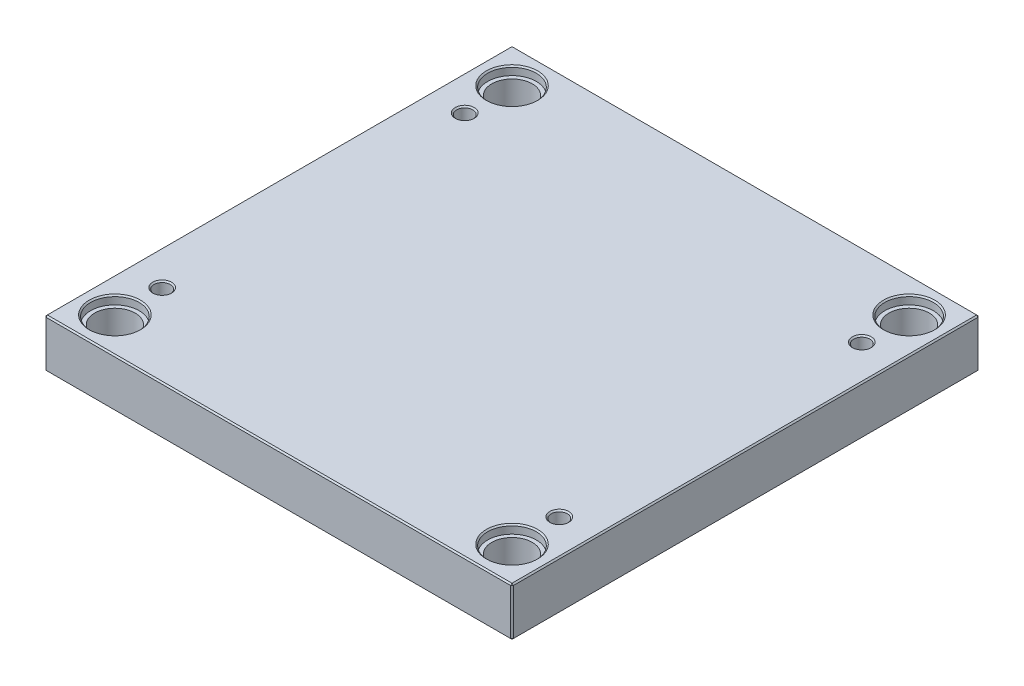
ISO-10303-21;
HEADER;
FILE_DESCRIPTION(('STEP AP214'),'2;1');
FILE_NAME('part.step','',(''),(''),'','','');
FILE_SCHEMA(('AUTOMOTIVE_DESIGN { 1 0 10303 214 1 1 1 1 }'));
ENDSEC;
DATA;
#1=APPLICATION_CONTEXT('core data for automotive mechanical design processes');
#2=APPLICATION_PROTOCOL_DEFINITION('international standard','automotive_design',2000,#1);
#3=PRODUCT_CONTEXT('',#1,'mechanical');
#4=PRODUCT('Part','Part','',(#3));
#5=PRODUCT_RELATED_PRODUCT_CATEGORY('part','',(#4));
#6=PRODUCT_DEFINITION_FORMATION('','',#4);
#7=PRODUCT_DEFINITION_CONTEXT('part definition',#1,'design');
#8=PRODUCT_DEFINITION('design','',#6,#7);
#9=PRODUCT_DEFINITION_SHAPE('','',#8);
#10=(LENGTH_UNIT() NAMED_UNIT(*) SI_UNIT(.MILLI.,.METRE.));
#11=(NAMED_UNIT(*) PLANE_ANGLE_UNIT() SI_UNIT($,.RADIAN.));
#12=(NAMED_UNIT(*) SI_UNIT($,.STERADIAN.) SOLID_ANGLE_UNIT());
#13=UNCERTAINTY_MEASURE_WITH_UNIT(LENGTH_MEASURE(1.E-05),#10,'distance_accuracy_value','');
#14=(GEOMETRIC_REPRESENTATION_CONTEXT(3) GLOBAL_UNCERTAINTY_ASSIGNED_CONTEXT((#13)) GLOBAL_UNIT_ASSIGNED_CONTEXT((#10,
#11,#12)) REPRESENTATION_CONTEXT('',''));
#15=CARTESIAN_POINT('',(0.,0.,0.));
#16=DIRECTION('',(0.,0.,1.));
#17=DIRECTION('',(1.,0.,0.));
#18=AXIS2_PLACEMENT_3D('',#15,#16,#17);
#19=CARTESIAN_POINT('',(-147.,0.,-147.));
#20=DIRECTION('',(0.,1.,0.));
#21=DIRECTION('',(0.,0.,1.));
#22=AXIS2_PLACEMENT_3D('',#19,#20,#21);
#23=CYLINDRICAL_SURFACE('',#22,15.);
#24=CARTESIAN_POINT('',(-147.,0.999999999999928,-147.));
#25=DIRECTION('',(0.,1.,0.));
#26=DIRECTION('',(0.,0.,1.));
#27=AXIS2_PLACEMENT_3D('',#24,#25,#26);
#28=CIRCLE('',#27,15.);
#29=CARTESIAN_POINT('',(-147.,0.999999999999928,-132.));
#30=VERTEX_POINT('',#29);
#31=EDGE_CURVE('E472',#30,#30,#28,.F.);
#32=ORIENTED_EDGE('',*,*,#31,.T.);
#33=EDGE_LOOP('',(#32));
#34=FACE_BOUND('',#33,.T.);
#35=CARTESIAN_POINT('',(-147.,29.7,-147.));
#36=DIRECTION('',(0.,1.,0.));
#37=DIRECTION('',(0.,0.,1.));
#38=AXIS2_PLACEMENT_3D('',#35,#36,#37);
#39=CIRCLE('',#38,15.);
#40=CARTESIAN_POINT('',(-147.,29.7,-132.));
#41=VERTEX_POINT('',#40);
#42=EDGE_CURVE('E221',#41,#41,#39,.F.);
#43=ORIENTED_EDGE('',*,*,#42,.F.);
#44=EDGE_LOOP('',(#43));
#45=FACE_BOUND('',#44,.T.);
#46=ADVANCED_FACE('F16',(#34,#45),#23,.F.);
#47=CARTESIAN_POINT('',(147.,0.,-147.));
#48=DIRECTION('',(0.,1.,0.));
#49=DIRECTION('',(0.,0.,1.));
#50=AXIS2_PLACEMENT_3D('',#47,#48,#49);
#51=CYLINDRICAL_SURFACE('',#50,15.);
#52=CARTESIAN_POINT('',(147.,0.999999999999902,-147.));
#53=DIRECTION('',(0.,1.,0.));
#54=DIRECTION('',(0.,0.,1.));
#55=AXIS2_PLACEMENT_3D('',#52,#53,#54);
#56=CIRCLE('',#55,15.);
#57=CARTESIAN_POINT('',(147.,0.999999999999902,-132.));
#58=VERTEX_POINT('',#57);
#59=EDGE_CURVE('E474',#58,#58,#56,.F.);
#60=ORIENTED_EDGE('',*,*,#59,.T.);
#61=EDGE_LOOP('',(#60));
#62=FACE_BOUND('',#61,.T.);
#63=CARTESIAN_POINT('',(147.,29.7,-147.));
#64=DIRECTION('',(0.,1.,0.));
#65=DIRECTION('',(0.,0.,1.));
#66=AXIS2_PLACEMENT_3D('',#63,#64,#65);
#67=CIRCLE('',#66,15.);
#68=CARTESIAN_POINT('',(147.,29.7,-132.));
#69=VERTEX_POINT('',#68);
#70=EDGE_CURVE('E218',#69,#69,#67,.F.);
#71=ORIENTED_EDGE('',*,*,#70,.F.);
#72=EDGE_LOOP('',(#71));
#73=FACE_BOUND('',#72,.T.);
#74=ADVANCED_FACE('F263',(#62,#73),#51,.F.);
#75=CARTESIAN_POINT('',(147.,0.,147.));
#76=DIRECTION('',(0.,1.,0.));
#77=DIRECTION('',(0.,0.,1.));
#78=AXIS2_PLACEMENT_3D('',#75,#76,#77);
#79=CYLINDRICAL_SURFACE('',#78,15.);
#80=CARTESIAN_POINT('',(147.,1.00000000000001,147.));
#81=DIRECTION('',(0.,1.,0.));
#82=DIRECTION('',(0.,0.,1.));
#83=AXIS2_PLACEMENT_3D('',#80,#81,#82);
#84=CIRCLE('',#83,15.);
#85=CARTESIAN_POINT('',(147.,1.00000000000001,162.));
#86=VERTEX_POINT('',#85);
#87=EDGE_CURVE('E477',#86,#86,#84,.F.);
#88=ORIENTED_EDGE('',*,*,#87,.T.);
#89=EDGE_LOOP('',(#88));
#90=FACE_BOUND('',#89,.T.);
#91=CARTESIAN_POINT('',(147.,29.7,147.));
#92=DIRECTION('',(0.,1.,0.));
#93=DIRECTION('',(0.,0.,1.));
#94=AXIS2_PLACEMENT_3D('',#91,#92,#93);
#95=CIRCLE('',#94,15.);
#96=CARTESIAN_POINT('',(147.,29.7,162.));
#97=VERTEX_POINT('',#96);
#98=EDGE_CURVE('E214',#97,#97,#95,.F.);
#99=ORIENTED_EDGE('',*,*,#98,.F.);
#100=EDGE_LOOP('',(#99));
#101=FACE_BOUND('',#100,.T.);
#102=ADVANCED_FACE('F270',(#90,#101),#79,.F.);
#103=CARTESIAN_POINT('',(-147.,0.,147.));
#104=DIRECTION('',(0.,1.,0.));
#105=DIRECTION('',(0.,0.,1.));
#106=AXIS2_PLACEMENT_3D('',#103,#104,#105);
#107=CYLINDRICAL_SURFACE('',#106,15.);
#108=CARTESIAN_POINT('',(-147.,0.999999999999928,147.));
#109=DIRECTION('',(0.,1.,0.));
#110=DIRECTION('',(0.,0.,1.));
#111=AXIS2_PLACEMENT_3D('',#108,#109,#110);
#112=CIRCLE('',#111,15.);
#113=CARTESIAN_POINT('',(-147.,0.999999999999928,162.));
#114=VERTEX_POINT('',#113);
#115=EDGE_CURVE('E480',#114,#114,#112,.F.);
#116=ORIENTED_EDGE('',*,*,#115,.T.);
#117=EDGE_LOOP('',(#116));
#118=FACE_BOUND('',#117,.T.);
#119=CARTESIAN_POINT('',(-147.,29.7,147.));
#120=DIRECTION('',(0.,1.,0.));
#121=DIRECTION('',(0.,0.,1.));
#122=AXIS2_PLACEMENT_3D('',#119,#120,#121);
#123=CIRCLE('',#122,15.);
#124=CARTESIAN_POINT('',(-147.,29.7,162.));
#125=VERTEX_POINT('',#124);
#126=EDGE_CURVE('E211',#125,#125,#123,.F.);
#127=ORIENTED_EDGE('',*,*,#126,.F.);
#128=EDGE_LOOP('',(#127));
#129=FACE_BOUND('',#128,.T.);
#130=ADVANCED_FACE('F277',(#118,#129),#107,.F.);
#131=CARTESIAN_POINT('',(-173.,36.,173.));
#132=DIRECTION('',(1.,0.,0.));
#133=DIRECTION('',(0.,0.,-1.));
#134=AXIS2_PLACEMENT_3D('',#131,#132,#133);
#135=PLANE('',#134);
#136=DIRECTION('',(0.,-1.,0.));
#137=VECTOR('',#136,1.);
#138=CARTESIAN_POINT('',(-173.,36.,-172.));
#139=LINE('',#138,#137);
#140=CARTESIAN_POINT('',(-173.,35.,-172.));
#141=VERTEX_POINT('',#140);
#142=CARTESIAN_POINT('',(-173.,1.00000000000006,-172.));
#143=VERTEX_POINT('',#142);
#144=EDGE_CURVE('E487',#141,#143,#139,.T.);
#145=ORIENTED_EDGE('',*,*,#144,.T.);
#146=DIRECTION('',(0.,0.,1.));
#147=VECTOR('',#146,1.);
#148=CARTESIAN_POINT('',(-173.,1.00000000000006,173.));
#149=LINE('',#148,#147);
#150=CARTESIAN_POINT('',(-173.,1.00000000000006,172.));
#151=VERTEX_POINT('',#150);
#152=EDGE_CURVE('E490',#143,#151,#149,.T.);
#153=ORIENTED_EDGE('',*,*,#152,.T.);
#154=DIRECTION('',(0.,1.,0.));
#155=VECTOR('',#154,1.);
#156=CARTESIAN_POINT('',(-173.,36.,172.));
#157=LINE('',#156,#155);
#158=CARTESIAN_POINT('',(-173.,35.,172.));
#159=VERTEX_POINT('',#158);
#160=EDGE_CURVE('E485',#151,#159,#157,.T.);
#161=ORIENTED_EDGE('',*,*,#160,.T.);
#162=DIRECTION('',(0.,0.,-1.));
#163=VECTOR('',#162,1.);
#164=CARTESIAN_POINT('',(-173.,35.,-173.));
#165=LINE('',#164,#163);
#166=EDGE_CURVE('E483',#159,#141,#165,.T.);
#167=ORIENTED_EDGE('',*,*,#166,.T.);
#168=EDGE_LOOP('',(#145,#153,#161,#167));
#169=FACE_BOUND('',#168,.T.);
#170=ADVANCED_FACE('F298',(#169),#135,.F.);
#171=CARTESIAN_POINT('',(173.,36.,173.));
#172=DIRECTION('',(0.,0.,-1.));
#173=DIRECTION('',(-1.,0.,0.));
#174=AXIS2_PLACEMENT_3D('',#171,#172,#173);
#175=PLANE('',#174);
#176=DIRECTION('',(-1.,0.,0.));
#177=VECTOR('',#176,1.);
#178=CARTESIAN_POINT('',(-173.,35.,173.));
#179=LINE('',#178,#177);
#180=CARTESIAN_POINT('',(172.,35.,173.));
#181=VERTEX_POINT('',#180);
#182=CARTESIAN_POINT('',(-172.,35.,173.));
#183=VERTEX_POINT('',#182);
#184=EDGE_CURVE('E509',#181,#183,#179,.T.);
#185=ORIENTED_EDGE('',*,*,#184,.T.);
#186=DIRECTION('',(0.,-1.,0.));
#187=VECTOR('',#186,1.);
#188=CARTESIAN_POINT('',(-172.,36.,173.));
#189=LINE('',#188,#187);
#190=CARTESIAN_POINT('',(-172.,1.00000000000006,173.));
#191=VERTEX_POINT('',#190);
#192=EDGE_CURVE('E515',#183,#191,#189,.T.);
#193=ORIENTED_EDGE('',*,*,#192,.T.);
#194=DIRECTION('',(1.,0.,0.));
#195=VECTOR('',#194,1.);
#196=CARTESIAN_POINT('',(173.,1.00000000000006,173.));
#197=LINE('',#196,#195);
#198=CARTESIAN_POINT('',(172.,1.00000000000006,173.));
#199=VERTEX_POINT('',#198);
#200=EDGE_CURVE('E513',#191,#199,#197,.T.);
#201=ORIENTED_EDGE('',*,*,#200,.T.);
#202=DIRECTION('',(0.,1.,0.));
#203=VECTOR('',#202,1.);
#204=CARTESIAN_POINT('',(172.,36.,173.));
#205=LINE('',#204,#203);
#206=EDGE_CURVE('E511',#199,#181,#205,.T.);
#207=ORIENTED_EDGE('',*,*,#206,.T.);
#208=EDGE_LOOP('',(#185,#193,#201,#207));
#209=FACE_BOUND('',#208,.T.);
#210=ADVANCED_FACE('F294',(#209),#175,.F.);
#211=CARTESIAN_POINT('',(173.,36.,173.));
#212=DIRECTION('',(-1.,0.,0.));
#213=DIRECTION('',(0.,0.,1.));
#214=AXIS2_PLACEMENT_3D('',#211,#212,#213);
#215=PLANE('',#214);
#216=DIRECTION('',(0.,0.,-1.));
#217=VECTOR('',#216,1.);
#218=CARTESIAN_POINT('',(173.,1.00000000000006,173.));
#219=LINE('',#218,#217);
#220=CARTESIAN_POINT('',(173.,1.00000000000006,172.));
#221=VERTEX_POINT('',#220);
#222=CARTESIAN_POINT('',(173.,1.00000000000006,-172.));
#223=VERTEX_POINT('',#222);
#224=EDGE_CURVE('E504',#221,#223,#219,.T.);
#225=ORIENTED_EDGE('',*,*,#224,.T.);
#226=DIRECTION('',(0.,1.,0.));
#227=VECTOR('',#226,1.);
#228=CARTESIAN_POINT('',(173.,36.,-172.));
#229=LINE('',#228,#227);
#230=CARTESIAN_POINT('',(173.,35.,-172.));
#231=VERTEX_POINT('',#230);
#232=EDGE_CURVE('E506',#223,#231,#229,.T.);
#233=ORIENTED_EDGE('',*,*,#232,.T.);
#234=DIRECTION('',(0.,0.,1.));
#235=VECTOR('',#234,1.);
#236=CARTESIAN_POINT('',(173.,35.,173.));
#237=LINE('',#236,#235);
#238=CARTESIAN_POINT('',(173.,35.,172.));
#239=VERTEX_POINT('',#238);
#240=EDGE_CURVE('E500',#231,#239,#237,.T.);
#241=ORIENTED_EDGE('',*,*,#240,.T.);
#242=DIRECTION('',(0.,-1.,0.));
#243=VECTOR('',#242,1.);
#244=CARTESIAN_POINT('',(173.,36.,172.));
#245=LINE('',#244,#243);
#246=EDGE_CURVE('E502',#239,#221,#245,.T.);
#247=ORIENTED_EDGE('',*,*,#246,.T.);
#248=EDGE_LOOP('',(#225,#233,#241,#247));
#249=FACE_BOUND('',#248,.T.);
#250=ADVANCED_FACE('F290',(#249),#215,.F.);
#251=CARTESIAN_POINT('',(173.,36.,-173.));
#252=DIRECTION('',(0.,0.,1.));
#253=DIRECTION('',(1.,0.,0.));
#254=AXIS2_PLACEMENT_3D('',#251,#252,#253);
#255=PLANE('',#254);
#256=DIRECTION('',(0.,-1.,0.));
#257=VECTOR('',#256,1.);
#258=CARTESIAN_POINT('',(172.,36.,-173.));
#259=LINE('',#258,#257);
#260=CARTESIAN_POINT('',(172.,35.,-173.));
#261=VERTEX_POINT('',#260);
#262=CARTESIAN_POINT('',(172.,1.00000000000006,-173.));
#263=VERTEX_POINT('',#262);
#264=EDGE_CURVE('E494',#261,#263,#259,.T.);
#265=ORIENTED_EDGE('',*,*,#264,.T.);
#266=DIRECTION('',(-1.,0.,0.));
#267=VECTOR('',#266,1.);
#268=CARTESIAN_POINT('',(173.,1.00000000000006,-173.));
#269=LINE('',#268,#267);
#270=CARTESIAN_POINT('',(-172.,1.00000000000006,-173.));
#271=VERTEX_POINT('',#270);
#272=EDGE_CURVE('E138',#263,#271,#269,.T.);
#273=ORIENTED_EDGE('',*,*,#272,.T.);
#274=DIRECTION('',(0.,1.,0.));
#275=VECTOR('',#274,1.);
#276=CARTESIAN_POINT('',(-172.,36.,-173.));
#277=LINE('',#276,#275);
#278=CARTESIAN_POINT('',(-172.,35.,-173.));
#279=VERTEX_POINT('',#278);
#280=EDGE_CURVE('E496',#271,#279,#277,.T.);
#281=ORIENTED_EDGE('',*,*,#280,.T.);
#282=DIRECTION('',(1.,0.,0.));
#283=VECTOR('',#282,1.);
#284=CARTESIAN_POINT('',(173.,35.,-173.));
#285=LINE('',#284,#283);
#286=EDGE_CURVE('E492',#279,#261,#285,.T.);
#287=ORIENTED_EDGE('',*,*,#286,.T.);
#288=EDGE_LOOP('',(#265,#273,#281,#287));
#289=FACE_BOUND('',#288,.T.);
#290=ADVANCED_FACE('F282',(#289),#255,.F.);
#291=CARTESIAN_POINT('',(0.,36.,0.));
#292=DIRECTION('',(0.,1.,0.));
#293=DIRECTION('',(0.,0.,1.));
#294=AXIS2_PLACEMENT_3D('',#291,#292,#293);
#295=PLANE('',#294);
#296=CARTESIAN_POINT('',(147.,36.,147.));
#297=DIRECTION('',(0.,1.,0.));
#298=DIRECTION('',(0.,0.,1.));
#299=AXIS2_PLACEMENT_3D('',#296,#297,#298);
#300=CIRCLE('',#299,19.);
#301=CARTESIAN_POINT('',(147.,36.,166.));
#302=VERTEX_POINT('',#301);
#303=EDGE_CURVE('E236',#302,#302,#300,.F.);
#304=ORIENTED_EDGE('',*,*,#303,.T.);
#305=EDGE_LOOP('',(#304));
#306=FACE_BOUND('',#305,.T.);
#307=CARTESIAN_POINT('',(-147.,36.,147.));
#308=DIRECTION('',(0.,1.,0.));
#309=DIRECTION('',(0.,0.,1.));
#310=AXIS2_PLACEMENT_3D('',#307,#308,#309);
#311=CIRCLE('',#310,19.);
#312=CARTESIAN_POINT('',(-147.,36.,166.));
#313=VERTEX_POINT('',#312);
#314=EDGE_CURVE('E233',#313,#313,#311,.F.);
#315=ORIENTED_EDGE('',*,*,#314,.T.);
#316=EDGE_LOOP('',(#315));
#317=FACE_BOUND('',#316,.T.);
#318=CARTESIAN_POINT('',(147.,36.,-147.));
#319=DIRECTION('',(0.,1.,0.));
#320=DIRECTION('',(0.,0.,1.));
#321=AXIS2_PLACEMENT_3D('',#318,#319,#320);
#322=CIRCLE('',#321,19.);
#323=CARTESIAN_POINT('',(147.,36.,-128.));
#324=VERTEX_POINT('',#323);
#325=EDGE_CURVE('E230',#324,#324,#322,.F.);
#326=ORIENTED_EDGE('',*,*,#325,.T.);
#327=EDGE_LOOP('',(#326));
#328=FACE_BOUND('',#327,.T.);
#329=CARTESIAN_POINT('',(-147.,36.,-147.));
#330=DIRECTION('',(0.,1.,0.));
#331=DIRECTION('',(0.,0.,1.));
#332=AXIS2_PLACEMENT_3D('',#329,#330,#331);
#333=CIRCLE('',#332,19.);
#334=CARTESIAN_POINT('',(-147.,36.,-128.));
#335=VERTEX_POINT('',#334);
#336=EDGE_CURVE('E227',#335,#335,#333,.F.);
#337=ORIENTED_EDGE('',*,*,#336,.T.);
#338=EDGE_LOOP('',(#337));
#339=FACE_BOUND('',#338,.T.);
#340=CARTESIAN_POINT('',(-147.,36.,112.));
#341=DIRECTION('',(0.,1.,0.));
#342=DIRECTION('',(0.,0.,1.));
#343=AXIS2_PLACEMENT_3D('',#340,#341,#342);
#344=CIRCLE('',#343,7.);
#345=CARTESIAN_POINT('',(-147.,36.,119.));
#346=VERTEX_POINT('',#345);
#347=EDGE_CURVE('E198',#346,#346,#344,.F.);
#348=ORIENTED_EDGE('',*,*,#347,.T.);
#349=EDGE_LOOP('',(#348));
#350=FACE_BOUND('',#349,.T.);
#351=CARTESIAN_POINT('',(147.,36.,112.));
#352=DIRECTION('',(0.,1.,0.));
#353=DIRECTION('',(0.,0.,1.));
#354=AXIS2_PLACEMENT_3D('',#351,#352,#353);
#355=CIRCLE('',#354,7.);
#356=CARTESIAN_POINT('',(147.,36.,119.));
#357=VERTEX_POINT('',#356);
#358=EDGE_CURVE('E195',#357,#357,#355,.F.);
#359=ORIENTED_EDGE('',*,*,#358,.T.);
#360=EDGE_LOOP('',(#359));
#361=FACE_BOUND('',#360,.T.);
#362=CARTESIAN_POINT('',(147.,36.,-112.));
#363=DIRECTION('',(0.,1.,0.));
#364=DIRECTION('',(0.,0.,1.));
#365=AXIS2_PLACEMENT_3D('',#362,#363,#364);
#366=CIRCLE('',#365,7.);
#367=CARTESIAN_POINT('',(147.,36.,-105.));
#368=VERTEX_POINT('',#367);
#369=EDGE_CURVE('E192',#368,#368,#366,.F.);
#370=ORIENTED_EDGE('',*,*,#369,.T.);
#371=EDGE_LOOP('',(#370));
#372=FACE_BOUND('',#371,.T.);
#373=CARTESIAN_POINT('',(-147.,36.,-112.));
#374=DIRECTION('',(0.,1.,0.));
#375=DIRECTION('',(0.,0.,1.));
#376=AXIS2_PLACEMENT_3D('',#373,#374,#375);
#377=CIRCLE('',#376,7.);
#378=CARTESIAN_POINT('',(-147.,36.,-105.));
#379=VERTEX_POINT('',#378);
#380=EDGE_CURVE('E188',#379,#379,#377,.F.);
#381=ORIENTED_EDGE('',*,*,#380,.T.);
#382=EDGE_LOOP('',(#381));
#383=FACE_BOUND('',#382,.T.);
#384=DIRECTION('',(0.,0.,-1.));
#385=VECTOR('',#384,1.);
#386=CARTESIAN_POINT('',(172.,36.,-173.));
#387=LINE('',#386,#385);
#388=CARTESIAN_POINT('',(172.,36.,172.));
#389=VERTEX_POINT('',#388);
#390=CARTESIAN_POINT('',(172.,36.,-172.));
#391=VERTEX_POINT('',#390);
#392=EDGE_CURVE('E31',#389,#391,#387,.T.);
#393=ORIENTED_EDGE('',*,*,#392,.T.);
#394=DIRECTION('',(-1.,0.,0.));
#395=VECTOR('',#394,1.);
#396=CARTESIAN_POINT('',(-173.,36.,-172.));
#397=LINE('',#396,#395);
#398=CARTESIAN_POINT('',(-172.,36.,-172.));
#399=VERTEX_POINT('',#398);
#400=EDGE_CURVE('E189',#391,#399,#397,.T.);
#401=ORIENTED_EDGE('',*,*,#400,.T.);
#402=DIRECTION('',(0.,0.,1.));
#403=VECTOR('',#402,1.);
#404=CARTESIAN_POINT('',(-172.,36.,173.));
#405=LINE('',#404,#403);
#406=CARTESIAN_POINT('',(-172.,36.,172.));
#407=VERTEX_POINT('',#406);
#408=EDGE_CURVE('E518',#399,#407,#405,.T.);
#409=ORIENTED_EDGE('',*,*,#408,.T.);
#410=DIRECTION('',(1.,0.,0.));
#411=VECTOR('',#410,1.);
#412=CARTESIAN_POINT('',(173.,36.,172.));
#413=LINE('',#412,#411);
#414=EDGE_CURVE('E36',#407,#389,#413,.T.);
#415=ORIENTED_EDGE('',*,*,#414,.T.);
#416=EDGE_LOOP('',(#393,#401,#409,#415));
#417=FACE_BOUND('',#416,.T.);
#418=ADVANCED_FACE('F279',(#306,#317,#328,#339,#350,#361,#372,#383,#417),#295,.T.);
#419=CARTESIAN_POINT('',(0.,0.,0.));
#420=DIRECTION('',(0.,1.,0.));
#421=DIRECTION('',(0.,0.,1.));
#422=AXIS2_PLACEMENT_3D('',#419,#420,#421);
#423=PLANE('',#422);
#424=CARTESIAN_POINT('',(-147.,0.,-147.));
#425=DIRECTION('',(0.,1.,0.));
#426=DIRECTION('',(0.,0.,1.));
#427=AXIS2_PLACEMENT_3D('',#424,#425,#426);
#428=CIRCLE('',#427,16.);
#429=CARTESIAN_POINT('',(-147.,0.,-131.));
#430=VERTEX_POINT('',#429);
#431=EDGE_CURVE('E469',#430,#430,#428,.T.);
#432=ORIENTED_EDGE('',*,*,#431,.T.);
#433=EDGE_LOOP('',(#432));
#434=FACE_BOUND('',#433,.T.);
#435=CARTESIAN_POINT('',(147.,0.,-147.));
#436=DIRECTION('',(0.,1.,0.));
#437=DIRECTION('',(0.,0.,1.));
#438=AXIS2_PLACEMENT_3D('',#435,#436,#437);
#439=CIRCLE('',#438,16.);
#440=CARTESIAN_POINT('',(147.,0.,-131.));
#441=VERTEX_POINT('',#440);
#442=EDGE_CURVE('E466',#441,#441,#439,.T.);
#443=ORIENTED_EDGE('',*,*,#442,.T.);
#444=EDGE_LOOP('',(#443));
#445=FACE_BOUND('',#444,.T.);
#446=CARTESIAN_POINT('',(147.,0.,147.));
#447=DIRECTION('',(0.,1.,0.));
#448=DIRECTION('',(0.,0.,1.));
#449=AXIS2_PLACEMENT_3D('',#446,#447,#448);
#450=CIRCLE('',#449,16.);
#451=CARTESIAN_POINT('',(147.,0.,163.));
#452=VERTEX_POINT('',#451);
#453=EDGE_CURVE('E463',#452,#452,#450,.T.);
#454=ORIENTED_EDGE('',*,*,#453,.T.);
#455=EDGE_LOOP('',(#454));
#456=FACE_BOUND('',#455,.T.);
#457=CARTESIAN_POINT('',(-147.,0.,147.));
#458=DIRECTION('',(0.,1.,0.));
#459=DIRECTION('',(0.,0.,1.));
#460=AXIS2_PLACEMENT_3D('',#457,#458,#459);
#461=CIRCLE('',#460,16.);
#462=CARTESIAN_POINT('',(-147.,0.,163.));
#463=VERTEX_POINT('',#462);
#464=EDGE_CURVE('E460',#463,#463,#461,.T.);
#465=ORIENTED_EDGE('',*,*,#464,.T.);
#466=EDGE_LOOP('',(#465));
#467=FACE_BOUND('',#466,.T.);
#468=DIRECTION('',(0.,0.,1.));
#469=VECTOR('',#468,1.);
#470=CARTESIAN_POINT('',(172.,0.,0.));
#471=LINE('',#470,#469);
#472=CARTESIAN_POINT('',(172.,0.,-172.));
#473=VERTEX_POINT('',#472);
#474=CARTESIAN_POINT('',(172.,0.,172.));
#475=VERTEX_POINT('',#474);
#476=EDGE_CURVE('E108',#473,#475,#471,.T.);
#477=ORIENTED_EDGE('',*,*,#476,.T.);
#478=DIRECTION('',(-1.,0.,0.));
#479=VECTOR('',#478,1.);
#480=CARTESIAN_POINT('',(0.,0.,172.));
#481=LINE('',#480,#479);
#482=CARTESIAN_POINT('',(-172.,0.,172.));
#483=VERTEX_POINT('',#482);
#484=EDGE_CURVE('E458',#475,#483,#481,.T.);
#485=ORIENTED_EDGE('',*,*,#484,.T.);
#486=DIRECTION('',(0.,0.,-1.));
#487=VECTOR('',#486,1.);
#488=CARTESIAN_POINT('',(-172.,0.,0.));
#489=LINE('',#488,#487);
#490=CARTESIAN_POINT('',(-172.,0.,-172.));
#491=VERTEX_POINT('',#490);
#492=EDGE_CURVE('E110',#483,#491,#489,.T.);
#493=ORIENTED_EDGE('',*,*,#492,.T.);
#494=DIRECTION('',(1.,0.,0.));
#495=VECTOR('',#494,1.);
#496=CARTESIAN_POINT('',(0.,0.,-172.));
#497=LINE('',#496,#495);
#498=EDGE_CURVE('E104',#491,#473,#497,.T.);
#499=ORIENTED_EDGE('',*,*,#498,.T.);
#500=EDGE_LOOP('',(#477,#485,#493,#499));
#501=FACE_BOUND('',#500,.T.);
#502=ADVANCED_FACE('F106',(#434,#445,#456,#467,#501),#423,.F.);
#503=CARTESIAN_POINT('',(-147.,0.,-147.));
#504=DIRECTION('',(0.,-1.,0.));
#505=DIRECTION('',(0.,0.,-1.));
#506=AXIS2_PLACEMENT_3D('',#503,#504,#505);
#507=CONICAL_SURFACE('',#506,16.,0.785398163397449);
#508=ORIENTED_EDGE('',*,*,#31,.F.);
#509=EDGE_LOOP('',(#508));
#510=FACE_BOUND('',#509,.T.);
#511=ORIENTED_EDGE('',*,*,#431,.F.);
#512=EDGE_LOOP('',(#511));
#513=FACE_BOUND('',#512,.T.);
#514=ADVANCED_FACE('F286',(#510,#513),#507,.F.);
#515=CARTESIAN_POINT('',(147.,0.,-147.));
#516=DIRECTION('',(0.,-1.,0.));
#517=DIRECTION('',(0.,0.,-1.));
#518=AXIS2_PLACEMENT_3D('',#515,#516,#517);
#519=CONICAL_SURFACE('',#518,16.,0.785398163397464);
#520=ORIENTED_EDGE('',*,*,#59,.F.);
#521=EDGE_LOOP('',(#520));
#522=FACE_BOUND('',#521,.T.);
#523=ORIENTED_EDGE('',*,*,#442,.F.);
#524=EDGE_LOOP('',(#523));
#525=FACE_BOUND('',#524,.T.);
#526=ADVANCED_FACE('F305',(#522,#525),#519,.F.);
#527=CARTESIAN_POINT('',(147.,0.,147.));
#528=DIRECTION('',(0.,-1.,0.));
#529=DIRECTION('',(0.,0.,-1.));
#530=AXIS2_PLACEMENT_3D('',#527,#528,#529);
#531=CONICAL_SURFACE('',#530,16.,0.785398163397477);
#532=ORIENTED_EDGE('',*,*,#87,.F.);
#533=EDGE_LOOP('',(#532));
#534=FACE_BOUND('',#533,.T.);
#535=ORIENTED_EDGE('',*,*,#453,.F.);
#536=EDGE_LOOP('',(#535));
#537=FACE_BOUND('',#536,.T.);
#538=ADVANCED_FACE('F309',(#534,#537),#531,.F.);
#539=CARTESIAN_POINT('',(-147.,0.,147.));
#540=DIRECTION('',(0.,-1.,0.));
#541=DIRECTION('',(0.,0.,-1.));
#542=AXIS2_PLACEMENT_3D('',#539,#540,#541);
#543=CONICAL_SURFACE('',#542,16.,0.785398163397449);
#544=ORIENTED_EDGE('',*,*,#115,.F.);
#545=EDGE_LOOP('',(#544));
#546=FACE_BOUND('',#545,.T.);
#547=ORIENTED_EDGE('',*,*,#464,.F.);
#548=EDGE_LOOP('',(#547));
#549=FACE_BOUND('',#548,.T.);
#550=ADVANCED_FACE('F313',(#546,#549),#543,.F.);
#551=CARTESIAN_POINT('',(173.,36.,172.));
#552=DIRECTION('',(-0.707106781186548,0.,-0.707106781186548));
#553=DIRECTION('',(0.,-1.,0.));
#554=AXIS2_PLACEMENT_3D('',#551,#552,#553);
#555=PLANE('',#554);
#556=DIRECTION('',(-0.707106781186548,0.,0.707106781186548));
#557=VECTOR('',#556,1.);
#558=CARTESIAN_POINT('',(172.,35.,173.));
#559=LINE('',#558,#557);
#560=EDGE_CURVE('E126',#181,#239,#559,.F.);
#561=ORIENTED_EDGE('',*,*,#560,.F.);
#562=ORIENTED_EDGE('',*,*,#206,.F.);
#563=DIRECTION('',(0.707106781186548,0.,-0.707106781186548));
#564=VECTOR('',#563,1.);
#565=CARTESIAN_POINT('',(172.,1.00000000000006,173.));
#566=LINE('',#565,#564);
#567=EDGE_CURVE('E180',#221,#199,#566,.F.);
#568=ORIENTED_EDGE('',*,*,#567,.F.);
#569=ORIENTED_EDGE('',*,*,#246,.F.);
#570=EDGE_LOOP('',(#561,#562,#568,#569));
#571=FACE_BOUND('',#570,.T.);
#572=ADVANCED_FACE('F317',(#571),#555,.F.);
#573=CARTESIAN_POINT('',(172.,35.,173.));
#574=DIRECTION('',(0.577350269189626,0.577350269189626,0.577350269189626));
#575=DIRECTION('',(0.707106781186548,0.,-0.707106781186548));
#576=AXIS2_PLACEMENT_3D('',#573,#574,#575);
#577=PLANE('',#576);
#578=DIRECTION('',(0.,-0.707106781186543,0.707106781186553));
#579=VECTOR('',#578,1.);
#580=CARTESIAN_POINT('',(172.,35.,173.));
#581=LINE('',#580,#579);
#582=EDGE_CURVE('E175',#181,#389,#581,.F.);
#583=ORIENTED_EDGE('',*,*,#582,.F.);
#584=ORIENTED_EDGE('',*,*,#560,.T.);
#585=DIRECTION('',(-0.707106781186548,0.707106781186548,0.));
#586=VECTOR('',#585,1.);
#587=CARTESIAN_POINT('',(172.5,35.5,172.));
#588=LINE('',#587,#586);
#589=EDGE_CURVE('E177',#389,#239,#588,.F.);
#590=ORIENTED_EDGE('',*,*,#589,.F.);
#591=EDGE_LOOP('',(#583,#584,#590));
#592=FACE_BOUND('',#591,.T.);
#593=ADVANCED_FACE('F385',(#592),#577,.T.);
#594=CARTESIAN_POINT('',(172.,1.00000000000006,173.));
#595=DIRECTION('',(0.577350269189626,-0.577350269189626,0.577350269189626));
#596=DIRECTION('',(0.707106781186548,0.,-0.707106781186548));
#597=AXIS2_PLACEMENT_3D('',#594,#595,#596);
#598=PLANE('',#597);
#599=DIRECTION('',(-0.707106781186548,-0.707106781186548,0.));
#600=VECTOR('',#599,1.);
#601=CARTESIAN_POINT('',(172.5,0.500000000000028,172.));
#602=LINE('',#601,#600);
#603=EDGE_CURVE('E124',#221,#475,#602,.T.);
#604=ORIENTED_EDGE('',*,*,#603,.F.);
#605=ORIENTED_EDGE('',*,*,#567,.T.);
#606=DIRECTION('',(0.,0.707106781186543,0.707106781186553));
#607=VECTOR('',#606,1.);
#608=CARTESIAN_POINT('',(172.,1.00000000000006,173.));
#609=LINE('',#608,#607);
#610=EDGE_CURVE('E172',#475,#199,#609,.T.);
#611=ORIENTED_EDGE('',*,*,#610,.F.);
#612=EDGE_LOOP('',(#604,#605,#611));
#613=FACE_BOUND('',#612,.T.);
#614=ADVANCED_FACE('F381',(#613),#598,.T.);
#615=CARTESIAN_POINT('',(172.,36.,0.));
#616=DIRECTION('',(0.707106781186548,0.707106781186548,0.));
#617=DIRECTION('',(0.,0.,1.));
#618=AXIS2_PLACEMENT_3D('',#615,#616,#617);
#619=PLANE('',#618);
#620=ORIENTED_EDGE('',*,*,#589,.T.);
#621=ORIENTED_EDGE('',*,*,#240,.F.);
#622=DIRECTION('',(0.707106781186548,-0.707106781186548,0.));
#623=VECTOR('',#622,1.);
#624=CARTESIAN_POINT('',(173.,35.,-172.));
#625=LINE('',#624,#623);
#626=EDGE_CURVE('E166',#391,#231,#625,.T.);
#627=ORIENTED_EDGE('',*,*,#626,.F.);
#628=ORIENTED_EDGE('',*,*,#392,.F.);
#629=EDGE_LOOP('',(#620,#621,#627,#628));
#630=FACE_BOUND('',#629,.T.);
#631=ADVANCED_FACE('F377',(#630),#619,.T.);
#632=CARTESIAN_POINT('',(0.,36.,172.));
#633=DIRECTION('',(0.,0.707106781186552,0.707106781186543));
#634=DIRECTION('',(-1.,0.,0.));
#635=AXIS2_PLACEMENT_3D('',#632,#633,#634);
#636=PLANE('',#635);
#637=ORIENTED_EDGE('',*,*,#582,.T.);
#638=ORIENTED_EDGE('',*,*,#414,.F.);
#639=DIRECTION('',(0.,0.707106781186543,-0.707106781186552));
#640=VECTOR('',#639,1.);
#641=CARTESIAN_POINT('',(-172.,35.5,172.5));
#642=LINE('',#641,#640);
#643=EDGE_CURVE('E163',#183,#407,#642,.T.);
#644=ORIENTED_EDGE('',*,*,#643,.F.);
#645=ORIENTED_EDGE('',*,*,#184,.F.);
#646=EDGE_LOOP('',(#637,#638,#644,#645));
#647=FACE_BOUND('',#646,.T.);
#648=ADVANCED_FACE('F373',(#647),#636,.T.);
#649=CARTESIAN_POINT('',(-172.,36.,173.));
#650=DIRECTION('',(0.707106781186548,0.,-0.707106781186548));
#651=DIRECTION('',(0.,-1.,0.));
#652=AXIS2_PLACEMENT_3D('',#649,#650,#651);
#653=PLANE('',#652);
#654=DIRECTION('',(0.707106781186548,0.,0.707106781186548));
#655=VECTOR('',#654,1.);
#656=CARTESIAN_POINT('',(-172.,1.00000000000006,173.));
#657=LINE('',#656,#655);
#658=EDGE_CURVE('E157',#191,#151,#657,.F.);
#659=ORIENTED_EDGE('',*,*,#658,.F.);
#660=ORIENTED_EDGE('',*,*,#192,.F.);
#661=DIRECTION('',(-0.707106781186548,0.,-0.707106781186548));
#662=VECTOR('',#661,1.);
#663=CARTESIAN_POINT('',(-173.,35.,172.));
#664=LINE('',#663,#662);
#665=EDGE_CURVE('E160',#159,#183,#664,.F.);
#666=ORIENTED_EDGE('',*,*,#665,.F.);
#667=ORIENTED_EDGE('',*,*,#160,.F.);
#668=EDGE_LOOP('',(#659,#660,#666,#667));
#669=FACE_BOUND('',#668,.T.);
#670=ADVANCED_FACE('F369',(#669),#653,.F.);
#671=CARTESIAN_POINT('',(173.,1.00000000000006,173.));
#672=DIRECTION('',(0.,0.707106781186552,-0.707106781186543));
#673=DIRECTION('',(1.,0.,0.));
#674=AXIS2_PLACEMENT_3D('',#671,#672,#673);
#675=PLANE('',#674);
#676=ORIENTED_EDGE('',*,*,#610,.T.);
#677=ORIENTED_EDGE('',*,*,#200,.F.);
#678=DIRECTION('',(0.,-0.707106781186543,-0.707106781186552));
#679=VECTOR('',#678,1.);
#680=CARTESIAN_POINT('',(-172.,1.00000000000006,173.));
#681=LINE('',#680,#679);
#682=EDGE_CURVE('E135',#483,#191,#681,.F.);
#683=ORIENTED_EDGE('',*,*,#682,.F.);
#684=ORIENTED_EDGE('',*,*,#484,.F.);
#685=EDGE_LOOP('',(#676,#677,#683,#684));
#686=FACE_BOUND('',#685,.T.);
#687=ADVANCED_FACE('F366',(#686),#675,.F.);
#688=CARTESIAN_POINT('',(173.,1.00000000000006,173.));
#689=DIRECTION('',(-0.707106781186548,0.707106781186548,0.));
#690=DIRECTION('',(0.,0.,-1.));
#691=AXIS2_PLACEMENT_3D('',#688,#689,#690);
#692=PLANE('',#691);
#693=ORIENTED_EDGE('',*,*,#603,.T.);
#694=ORIENTED_EDGE('',*,*,#476,.F.);
#695=DIRECTION('',(0.707106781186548,0.707106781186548,0.));
#696=VECTOR('',#695,1.);
#697=CARTESIAN_POINT('',(172.5,0.500000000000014,-172.));
#698=LINE('',#697,#696);
#699=EDGE_CURVE('E121',#223,#473,#698,.F.);
#700=ORIENTED_EDGE('',*,*,#699,.F.);
#701=ORIENTED_EDGE('',*,*,#224,.F.);
#702=EDGE_LOOP('',(#693,#694,#700,#701));
#703=FACE_BOUND('',#702,.T.);
#704=ADVANCED_FACE('F119',(#703),#692,.F.);
#705=CARTESIAN_POINT('',(172.,36.,-173.));
#706=DIRECTION('',(-0.707106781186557,0.,0.707106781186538));
#707=DIRECTION('',(0.,-1.,0.));
#708=AXIS2_PLACEMENT_3D('',#705,#706,#707);
#709=PLANE('',#708);
#710=DIRECTION('',(0.707106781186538,0.,0.707106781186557));
#711=VECTOR('',#710,1.);
#712=CARTESIAN_POINT('',(173.,35.,-172.));
#713=LINE('',#712,#711);
#714=EDGE_CURVE('E168',#231,#261,#713,.F.);
#715=ORIENTED_EDGE('',*,*,#714,.F.);
#716=ORIENTED_EDGE('',*,*,#232,.F.);
#717=DIRECTION('',(-0.707106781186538,0.,-0.707106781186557));
#718=VECTOR('',#717,1.);
#719=CARTESIAN_POINT('',(172.,1.00000000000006,-173.));
#720=LINE('',#719,#718);
#721=EDGE_CURVE('E134',#263,#223,#720,.F.);
#722=ORIENTED_EDGE('',*,*,#721,.F.);
#723=ORIENTED_EDGE('',*,*,#264,.F.);
#724=EDGE_LOOP('',(#715,#716,#722,#723));
#725=FACE_BOUND('',#724,.T.);
#726=ADVANCED_FACE('F359',(#725),#709,.F.);
#727=CARTESIAN_POINT('',(173.,35.,-172.));
#728=DIRECTION('',(0.577350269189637,0.57735026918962,-0.57735026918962));
#729=DIRECTION('',(-0.707106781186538,0.,-0.707106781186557));
#730=AXIS2_PLACEMENT_3D('',#727,#728,#729);
#731=PLANE('',#730);
#732=ORIENTED_EDGE('',*,*,#626,.T.);
#733=ORIENTED_EDGE('',*,*,#714,.T.);
#734=DIRECTION('',(0.,0.707106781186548,0.707106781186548));
#735=VECTOR('',#734,1.);
#736=CARTESIAN_POINT('',(172.,35.5,-172.5));
#737=LINE('',#736,#735);
#738=EDGE_CURVE('E152',#391,#261,#737,.F.);
#739=ORIENTED_EDGE('',*,*,#738,.F.);
#740=EDGE_LOOP('',(#732,#733,#739));
#741=FACE_BOUND('',#740,.T.);
#742=ADVANCED_FACE('F355',(#741),#731,.T.);
#743=CARTESIAN_POINT('',(-173.,35.,172.));
#744=DIRECTION('',(-0.577350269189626,0.577350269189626,0.577350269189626));
#745=DIRECTION('',(0.707106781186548,0.,0.707106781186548));
#746=AXIS2_PLACEMENT_3D('',#743,#744,#745);
#747=PLANE('',#746);
#748=ORIENTED_EDGE('',*,*,#665,.T.);
#749=ORIENTED_EDGE('',*,*,#643,.T.);
#750=DIRECTION('',(-0.707106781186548,-0.707106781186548,0.));
#751=VECTOR('',#750,1.);
#752=CARTESIAN_POINT('',(-173.,35.,172.));
#753=LINE('',#752,#751);
#754=EDGE_CURVE('E143',#159,#407,#753,.F.);
#755=ORIENTED_EDGE('',*,*,#754,.F.);
#756=EDGE_LOOP('',(#748,#749,#755));
#757=FACE_BOUND('',#756,.T.);
#758=ADVANCED_FACE('F351',(#757),#747,.T.);
#759=CARTESIAN_POINT('',(-172.,1.00000000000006,173.));
#760=DIRECTION('',(-0.577350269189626,-0.577350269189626,0.577350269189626));
#761=DIRECTION('',(0.707106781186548,0.,0.707106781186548));
#762=AXIS2_PLACEMENT_3D('',#759,#760,#761);
#763=PLANE('',#762);
#764=ORIENTED_EDGE('',*,*,#682,.T.);
#765=ORIENTED_EDGE('',*,*,#658,.T.);
#766=DIRECTION('',(-0.707106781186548,0.707106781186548,0.));
#767=VECTOR('',#766,1.);
#768=CARTESIAN_POINT('',(-172.5,0.500000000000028,172.));
#769=LINE('',#768,#767);
#770=EDGE_CURVE('E139',#483,#151,#769,.T.);
#771=ORIENTED_EDGE('',*,*,#770,.F.);
#772=EDGE_LOOP('',(#764,#765,#771));
#773=FACE_BOUND('',#772,.T.);
#774=ADVANCED_FACE('F348',(#773),#763,.T.);
#775=CARTESIAN_POINT('',(172.,1.00000000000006,-173.));
#776=DIRECTION('',(0.577350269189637,-0.57735026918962,-0.57735026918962));
#777=DIRECTION('',(-0.707106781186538,0.,-0.707106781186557));
#778=AXIS2_PLACEMENT_3D('',#775,#776,#777);
#779=PLANE('',#778);
#780=ORIENTED_EDGE('',*,*,#721,.T.);
#781=ORIENTED_EDGE('',*,*,#699,.T.);
#782=DIRECTION('',(0.,-0.707106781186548,0.707106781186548));
#783=VECTOR('',#782,1.);
#784=CARTESIAN_POINT('',(172.,1.00000000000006,-173.));
#785=LINE('',#784,#783);
#786=EDGE_CURVE('E131',#263,#473,#785,.T.);
#787=ORIENTED_EDGE('',*,*,#786,.F.);
#788=EDGE_LOOP('',(#780,#781,#787));
#789=FACE_BOUND('',#788,.T.);
#790=ADVANCED_FACE('F130',(#789),#779,.T.);
#791=CARTESIAN_POINT('',(0.,36.,-172.));
#792=DIRECTION('',(0.,0.707106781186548,-0.707106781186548));
#793=DIRECTION('',(1.,0.,0.));
#794=AXIS2_PLACEMENT_3D('',#791,#792,#793);
#795=PLANE('',#794);
#796=ORIENTED_EDGE('',*,*,#738,.T.);
#797=ORIENTED_EDGE('',*,*,#286,.F.);
#798=DIRECTION('',(0.,-0.707106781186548,-0.707106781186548));
#799=VECTOR('',#798,1.);
#800=CARTESIAN_POINT('',(-172.,35.,-173.));
#801=LINE('',#800,#799);
#802=EDGE_CURVE('E140',#399,#279,#801,.T.);
#803=ORIENTED_EDGE('',*,*,#802,.F.);
#804=ORIENTED_EDGE('',*,*,#400,.F.);
#805=EDGE_LOOP('',(#796,#797,#803,#804));
#806=FACE_BOUND('',#805,.T.);
#807=ADVANCED_FACE('F341',(#806),#795,.T.);
#808=CARTESIAN_POINT('',(-172.,36.,0.));
#809=DIRECTION('',(-0.707106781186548,0.707106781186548,0.));
#810=DIRECTION('',(0.,0.,-1.));
#811=AXIS2_PLACEMENT_3D('',#808,#809,#810);
#812=PLANE('',#811);
#813=ORIENTED_EDGE('',*,*,#754,.T.);
#814=ORIENTED_EDGE('',*,*,#408,.F.);
#815=DIRECTION('',(0.707106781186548,0.707106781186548,0.));
#816=VECTOR('',#815,1.);
#817=CARTESIAN_POINT('',(-172.5,35.5,-172.));
#818=LINE('',#817,#816);
#819=EDGE_CURVE('E146',#141,#399,#818,.T.);
#820=ORIENTED_EDGE('',*,*,#819,.F.);
#821=ORIENTED_EDGE('',*,*,#166,.F.);
#822=EDGE_LOOP('',(#813,#814,#820,#821));
#823=FACE_BOUND('',#822,.T.);
#824=ADVANCED_FACE('F337',(#823),#812,.T.);
#825=CARTESIAN_POINT('',(-173.,1.00000000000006,173.));
#826=DIRECTION('',(0.707106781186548,0.707106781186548,0.));
#827=DIRECTION('',(0.,0.,1.));
#828=AXIS2_PLACEMENT_3D('',#825,#826,#827);
#829=PLANE('',#828);
#830=ORIENTED_EDGE('',*,*,#770,.T.);
#831=ORIENTED_EDGE('',*,*,#152,.F.);
#832=DIRECTION('',(0.707106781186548,-0.707106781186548,0.));
#833=VECTOR('',#832,1.);
#834=CARTESIAN_POINT('',(-173.,1.00000000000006,-172.));
#835=LINE('',#834,#833);
#836=EDGE_CURVE('E529',#491,#143,#835,.F.);
#837=ORIENTED_EDGE('',*,*,#836,.F.);
#838=ORIENTED_EDGE('',*,*,#492,.F.);
#839=EDGE_LOOP('',(#830,#831,#837,#838));
#840=FACE_BOUND('',#839,.T.);
#841=ADVANCED_FACE('F334',(#840),#829,.F.);
#842=CARTESIAN_POINT('',(173.,1.00000000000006,-173.));
#843=DIRECTION('',(0.,0.707106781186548,0.707106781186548));
#844=DIRECTION('',(-1.,0.,0.));
#845=AXIS2_PLACEMENT_3D('',#842,#843,#844);
#846=PLANE('',#845);
#847=ORIENTED_EDGE('',*,*,#786,.T.);
#848=ORIENTED_EDGE('',*,*,#498,.F.);
#849=DIRECTION('',(0.,0.707106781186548,-0.707106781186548));
#850=VECTOR('',#849,1.);
#851=CARTESIAN_POINT('',(-172.,0.500000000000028,-172.5));
#852=LINE('',#851,#850);
#853=EDGE_CURVE('E526',#271,#491,#852,.F.);
#854=ORIENTED_EDGE('',*,*,#853,.F.);
#855=ORIENTED_EDGE('',*,*,#272,.F.);
#856=EDGE_LOOP('',(#847,#848,#854,#855));
#857=FACE_BOUND('',#856,.T.);
#858=ADVANCED_FACE('F137',(#857),#846,.F.);
#859=CARTESIAN_POINT('',(-172.,35.,-173.));
#860=DIRECTION('',(-0.577350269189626,0.577350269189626,-0.577350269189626));
#861=DIRECTION('',(-0.707106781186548,0.,0.707106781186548));
#862=AXIS2_PLACEMENT_3D('',#859,#860,#861);
#863=PLANE('',#862);
#864=ORIENTED_EDGE('',*,*,#819,.T.);
#865=ORIENTED_EDGE('',*,*,#802,.T.);
#866=DIRECTION('',(0.707106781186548,0.,-0.707106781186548));
#867=VECTOR('',#866,1.);
#868=CARTESIAN_POINT('',(-172.,35.,-173.));
#869=LINE('',#868,#867);
#870=EDGE_CURVE('E524',#141,#279,#869,.T.);
#871=ORIENTED_EDGE('',*,*,#870,.F.);
#872=EDGE_LOOP('',(#864,#865,#871));
#873=FACE_BOUND('',#872,.T.);
#874=ADVANCED_FACE('F327',(#873),#863,.T.);
#875=CARTESIAN_POINT('',(-173.,1.00000000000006,-172.));
#876=DIRECTION('',(-0.577350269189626,-0.577350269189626,-0.577350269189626));
#877=DIRECTION('',(-0.707106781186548,0.,0.707106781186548));
#878=AXIS2_PLACEMENT_3D('',#875,#876,#877);
#879=PLANE('',#878);
#880=ORIENTED_EDGE('',*,*,#853,.T.);
#881=ORIENTED_EDGE('',*,*,#836,.T.);
#882=DIRECTION('',(-0.707106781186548,0.,0.707106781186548));
#883=VECTOR('',#882,1.);
#884=CARTESIAN_POINT('',(-173.,1.00000000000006,-172.));
#885=LINE('',#884,#883);
#886=EDGE_CURVE('E455',#271,#143,#885,.T.);
#887=ORIENTED_EDGE('',*,*,#886,.F.);
#888=EDGE_LOOP('',(#880,#881,#887));
#889=FACE_BOUND('',#888,.T.);
#890=ADVANCED_FACE('F323',(#889),#879,.T.);
#891=CARTESIAN_POINT('',(-173.,36.,-172.));
#892=DIRECTION('',(0.707106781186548,0.,0.707106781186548));
#893=DIRECTION('',(0.,-1.,0.));
#894=AXIS2_PLACEMENT_3D('',#891,#892,#893);
#895=PLANE('',#894);
#896=ORIENTED_EDGE('',*,*,#870,.T.);
#897=ORIENTED_EDGE('',*,*,#280,.F.);
#898=ORIENTED_EDGE('',*,*,#886,.T.);
#899=ORIENTED_EDGE('',*,*,#144,.F.);
#900=EDGE_LOOP('',(#896,#897,#898,#899));
#901=FACE_BOUND('',#900,.T.);
#902=ADVANCED_FACE('F319',(#901),#895,.F.);
#903=CARTESIAN_POINT('',(-147.,12.,-112.));
#904=DIRECTION('',(0.,1.,0.));
#905=DIRECTION('',(0.,0.,1.));
#906=AXIS2_PLACEMENT_3D('',#903,#904,#905);
#907=CYLINDRICAL_SURFACE('',#906,6.);
#908=CARTESIAN_POINT('',(-147.,35.,-112.));
#909=DIRECTION('',(0.,1.,0.));
#910=DIRECTION('',(0.,0.,1.));
#911=AXIS2_PLACEMENT_3D('',#908,#909,#910);
#912=CIRCLE('',#911,6.);
#913=CARTESIAN_POINT('',(-147.,35.,-106.));
#914=VERTEX_POINT('',#913);
#915=EDGE_CURVE('E207',#914,#914,#912,.T.);
#916=ORIENTED_EDGE('',*,*,#915,.T.);
#917=EDGE_LOOP('',(#916));
#918=FACE_BOUND('',#917,.T.);
#919=CARTESIAN_POINT('',(-147.,12.,-112.));
#920=DIRECTION('',(0.,1.,0.));
#921=DIRECTION('',(0.,0.,1.));
#922=AXIS2_PLACEMENT_3D('',#919,#920,#921);
#923=CIRCLE('',#922,6.);
#924=CARTESIAN_POINT('',(-147.,12.,-106.));
#925=VERTEX_POINT('',#924);
#926=EDGE_CURVE('E448',#925,#925,#923,.T.);
#927=ORIENTED_EDGE('',*,*,#926,.F.);
#928=EDGE_LOOP('',(#927));
#929=FACE_BOUND('',#928,.T.);
#930=ADVANCED_FACE('F322',(#918,#929),#907,.F.);
#931=CARTESIAN_POINT('',(-147.,12.,-112.));
#932=DIRECTION('',(0.,1.,0.));
#933=DIRECTION('',(0.,0.,1.));
#934=AXIS2_PLACEMENT_3D('',#931,#932,#933);
#935=PLANE('',#934);
#936=ORIENTED_EDGE('',*,*,#926,.T.);
#937=EDGE_LOOP('',(#936));
#938=FACE_BOUND('',#937,.T.);
#939=ADVANCED_FACE('F596',(#938),#935,.T.);
#940=CARTESIAN_POINT('',(147.,12.,-112.));
#941=DIRECTION('',(0.,1.,0.));
#942=DIRECTION('',(0.,0.,1.));
#943=AXIS2_PLACEMENT_3D('',#940,#941,#942);
#944=CYLINDRICAL_SURFACE('',#943,6.);
#945=CARTESIAN_POINT('',(147.,35.,-112.));
#946=DIRECTION('',(0.,1.,0.));
#947=DIRECTION('',(0.,0.,1.));
#948=AXIS2_PLACEMENT_3D('',#945,#946,#947);
#949=CIRCLE('',#948,6.);
#950=CARTESIAN_POINT('',(147.,35.,-106.));
#951=VERTEX_POINT('',#950);
#952=EDGE_CURVE('E204',#951,#951,#949,.T.);
#953=ORIENTED_EDGE('',*,*,#952,.T.);
#954=EDGE_LOOP('',(#953));
#955=FACE_BOUND('',#954,.T.);
#956=CARTESIAN_POINT('',(147.,12.,-112.));
#957=DIRECTION('',(0.,1.,0.));
#958=DIRECTION('',(0.,0.,1.));
#959=AXIS2_PLACEMENT_3D('',#956,#957,#958);
#960=CIRCLE('',#959,6.);
#961=CARTESIAN_POINT('',(147.,12.,-106.));
#962=VERTEX_POINT('',#961);
#963=EDGE_CURVE('E445',#962,#962,#960,.T.);
#964=ORIENTED_EDGE('',*,*,#963,.F.);
#965=EDGE_LOOP('',(#964));
#966=FACE_BOUND('',#965,.T.);
#967=ADVANCED_FACE('F592',(#955,#966),#944,.F.);
#968=CARTESIAN_POINT('',(147.,12.,-112.));
#969=DIRECTION('',(0.,1.,0.));
#970=DIRECTION('',(0.,0.,1.));
#971=AXIS2_PLACEMENT_3D('',#968,#969,#970);
#972=PLANE('',#971);
#973=ORIENTED_EDGE('',*,*,#963,.T.);
#974=EDGE_LOOP('',(#973));
#975=FACE_BOUND('',#974,.T.);
#976=ADVANCED_FACE('F588',(#975),#972,.T.);
#977=CARTESIAN_POINT('',(147.,12.,112.));
#978=DIRECTION('',(0.,1.,0.));
#979=DIRECTION('',(0.,0.,1.));
#980=AXIS2_PLACEMENT_3D('',#977,#978,#979);
#981=CYLINDRICAL_SURFACE('',#980,6.);
#982=CARTESIAN_POINT('',(147.,35.,112.));
#983=DIRECTION('',(0.,1.,0.));
#984=DIRECTION('',(0.,0.,1.));
#985=AXIS2_PLACEMENT_3D('',#982,#983,#984);
#986=CIRCLE('',#985,6.);
#987=CARTESIAN_POINT('',(147.,35.,118.));
#988=VERTEX_POINT('',#987);
#989=EDGE_CURVE('E201',#988,#988,#986,.T.);
#990=ORIENTED_EDGE('',*,*,#989,.T.);
#991=EDGE_LOOP('',(#990));
#992=FACE_BOUND('',#991,.T.);
#993=CARTESIAN_POINT('',(147.,12.,112.));
#994=DIRECTION('',(0.,1.,0.));
#995=DIRECTION('',(0.,0.,1.));
#996=AXIS2_PLACEMENT_3D('',#993,#994,#995);
#997=CIRCLE('',#996,6.);
#998=CARTESIAN_POINT('',(147.,12.,118.));
#999=VERTEX_POINT('',#998);
#1000=EDGE_CURVE('E449',#999,#999,#997,.T.);
#1001=ORIENTED_EDGE('',*,*,#1000,.F.);
#1002=EDGE_LOOP('',(#1001));
#1003=FACE_BOUND('',#1002,.T.);
#1004=ADVANCED_FACE('F591',(#992,#1003),#981,.F.);
#1005=CARTESIAN_POINT('',(147.,12.,112.));
#1006=DIRECTION('',(0.,1.,0.));
#1007=DIRECTION('',(0.,0.,1.));
#1008=AXIS2_PLACEMENT_3D('',#1005,#1006,#1007);
#1009=PLANE('',#1008);
#1010=ORIENTED_EDGE('',*,*,#1000,.T.);
#1011=EDGE_LOOP('',(#1010));
#1012=FACE_BOUND('',#1011,.T.);
#1013=ADVANCED_FACE('F598',(#1012),#1009,.T.);
#1014=CARTESIAN_POINT('',(-147.,12.,112.));
#1015=DIRECTION('',(0.,1.,0.));
#1016=DIRECTION('',(0.,0.,1.));
#1017=AXIS2_PLACEMENT_3D('',#1014,#1015,#1016);
#1018=CYLINDRICAL_SURFACE('',#1017,6.);
#1019=CARTESIAN_POINT('',(-147.,35.,112.));
#1020=DIRECTION('',(0.,1.,0.));
#1021=DIRECTION('',(0.,0.,1.));
#1022=AXIS2_PLACEMENT_3D('',#1019,#1020,#1021);
#1023=CIRCLE('',#1022,6.);
#1024=CARTESIAN_POINT('',(-147.,35.,118.));
#1025=VERTEX_POINT('',#1024);
#1026=EDGE_CURVE('E185',#1025,#1025,#1023,.T.);
#1027=ORIENTED_EDGE('',*,*,#1026,.T.);
#1028=EDGE_LOOP('',(#1027));
#1029=FACE_BOUND('',#1028,.T.);
#1030=CARTESIAN_POINT('',(-147.,12.,112.));
#1031=DIRECTION('',(0.,1.,0.));
#1032=DIRECTION('',(0.,0.,1.));
#1033=AXIS2_PLACEMENT_3D('',#1030,#1031,#1032);
#1034=CIRCLE('',#1033,6.);
#1035=CARTESIAN_POINT('',(-147.,12.,118.));
#1036=VERTEX_POINT('',#1035);
#1037=EDGE_CURVE('E224',#1036,#1036,#1034,.T.);
#1038=ORIENTED_EDGE('',*,*,#1037,.F.);
#1039=EDGE_LOOP('',(#1038));
#1040=FACE_BOUND('',#1039,.T.);
#1041=ADVANCED_FACE('F601',(#1029,#1040),#1018,.F.);
#1042=CARTESIAN_POINT('',(-147.,12.,112.));
#1043=DIRECTION('',(0.,1.,0.));
#1044=DIRECTION('',(0.,0.,1.));
#1045=AXIS2_PLACEMENT_3D('',#1042,#1043,#1044);
#1046=PLANE('',#1045);
#1047=ORIENTED_EDGE('',*,*,#1037,.T.);
#1048=EDGE_LOOP('',(#1047));
#1049=FACE_BOUND('',#1048,.T.);
#1050=ADVANCED_FACE('F397',(#1049),#1046,.T.);
#1051=CARTESIAN_POINT('',(-147.,35.,112.));
#1052=DIRECTION('',(0.,1.,0.));
#1053=DIRECTION('',(0.,0.,1.));
#1054=AXIS2_PLACEMENT_3D('',#1051,#1052,#1053);
#1055=CONICAL_SURFACE('',#1054,6.,0.785398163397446);
#1056=ORIENTED_EDGE('',*,*,#347,.F.);
#1057=EDGE_LOOP('',(#1056));
#1058=FACE_BOUND('',#1057,.T.);
#1059=ORIENTED_EDGE('',*,*,#1026,.F.);
#1060=EDGE_LOOP('',(#1059));
#1061=FACE_BOUND('',#1060,.T.);
#1062=ADVANCED_FACE('F393',(#1058,#1061),#1055,.F.);
#1063=CARTESIAN_POINT('',(147.,35.,112.));
#1064=DIRECTION('',(0.,1.,0.));
#1065=DIRECTION('',(0.,0.,1.));
#1066=AXIS2_PLACEMENT_3D('',#1063,#1064,#1065);
#1067=CONICAL_SURFACE('',#1066,6.,0.785398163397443);
#1068=ORIENTED_EDGE('',*,*,#358,.F.);
#1069=EDGE_LOOP('',(#1068));
#1070=FACE_BOUND('',#1069,.T.);
#1071=ORIENTED_EDGE('',*,*,#989,.F.);
#1072=EDGE_LOOP('',(#1071));
#1073=FACE_BOUND('',#1072,.T.);
#1074=ADVANCED_FACE('F396',(#1070,#1073),#1067,.F.);
#1075=CARTESIAN_POINT('',(147.,35.,-112.));
#1076=DIRECTION('',(0.,1.,0.));
#1077=DIRECTION('',(0.,0.,1.));
#1078=AXIS2_PLACEMENT_3D('',#1075,#1076,#1077);
#1079=CONICAL_SURFACE('',#1078,6.,0.785398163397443);
#1080=ORIENTED_EDGE('',*,*,#369,.F.);
#1081=EDGE_LOOP('',(#1080));
#1082=FACE_BOUND('',#1081,.T.);
#1083=ORIENTED_EDGE('',*,*,#952,.F.);
#1084=EDGE_LOOP('',(#1083));
#1085=FACE_BOUND('',#1084,.T.);
#1086=ADVANCED_FACE('F401',(#1082,#1085),#1079,.F.);
#1087=CARTESIAN_POINT('',(-147.,35.,-112.));
#1088=DIRECTION('',(0.,1.,0.));
#1089=DIRECTION('',(0.,0.,1.));
#1090=AXIS2_PLACEMENT_3D('',#1087,#1088,#1089);
#1091=CONICAL_SURFACE('',#1090,6.,0.785398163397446);
#1092=ORIENTED_EDGE('',*,*,#380,.F.);
#1093=EDGE_LOOP('',(#1092));
#1094=FACE_BOUND('',#1093,.T.);
#1095=ORIENTED_EDGE('',*,*,#915,.F.);
#1096=EDGE_LOOP('',(#1095));
#1097=FACE_BOUND('',#1096,.T.);
#1098=ADVANCED_FACE('F405',(#1094,#1097),#1091,.F.);
#1099=CARTESIAN_POINT('',(-147.,29.7,147.));
#1100=DIRECTION('',(0.,1.,0.));
#1101=DIRECTION('',(0.,0.,1.));
#1102=AXIS2_PLACEMENT_3D('',#1099,#1100,#1101);
#1103=PLANE('',#1102);
#1104=CARTESIAN_POINT('',(-147.,29.7,147.));
#1105=DIRECTION('',(0.,1.,0.));
#1106=DIRECTION('',(0.,0.,1.));
#1107=AXIS2_PLACEMENT_3D('',#1104,#1105,#1106);
#1108=CIRCLE('',#1107,18.);
#1109=CARTESIAN_POINT('',(-147.,29.7,165.));
#1110=VERTEX_POINT('',#1109);
#1111=EDGE_CURVE('E436',#1110,#1110,#1108,.T.);
#1112=ORIENTED_EDGE('',*,*,#1111,.T.);
#1113=EDGE_LOOP('',(#1112));
#1114=FACE_BOUND('',#1113,.T.);
#1115=ORIENTED_EDGE('',*,*,#126,.T.);
#1116=EDGE_LOOP('',(#1115));
#1117=FACE_BOUND('',#1116,.T.);
#1118=ADVANCED_FACE('F409',(#1114,#1117),#1103,.T.);
#1119=CARTESIAN_POINT('',(-147.,29.7,147.));
#1120=DIRECTION('',(0.,1.,0.));
#1121=DIRECTION('',(0.,0.,1.));
#1122=AXIS2_PLACEMENT_3D('',#1119,#1120,#1121);
#1123=CYLINDRICAL_SURFACE('',#1122,18.);
#1124=CARTESIAN_POINT('',(-147.,35.,147.));
#1125=DIRECTION('',(0.,1.,0.));
#1126=DIRECTION('',(0.,0.,1.));
#1127=AXIS2_PLACEMENT_3D('',#1124,#1125,#1126);
#1128=CIRCLE('',#1127,18.);
#1129=CARTESIAN_POINT('',(-147.,35.,165.));
#1130=VERTEX_POINT('',#1129);
#1131=EDGE_CURVE('E239',#1130,#1130,#1128,.T.);
#1132=ORIENTED_EDGE('',*,*,#1131,.T.);
#1133=EDGE_LOOP('',(#1132));
#1134=FACE_BOUND('',#1133,.T.);
#1135=ORIENTED_EDGE('',*,*,#1111,.F.);
#1136=EDGE_LOOP('',(#1135));
#1137=FACE_BOUND('',#1136,.T.);
#1138=ADVANCED_FACE('F574',(#1134,#1137),#1123,.F.);
#1139=CARTESIAN_POINT('',(147.,29.7,147.));
#1140=DIRECTION('',(0.,1.,0.));
#1141=DIRECTION('',(0.,0.,1.));
#1142=AXIS2_PLACEMENT_3D('',#1139,#1140,#1141);
#1143=PLANE('',#1142);
#1144=CARTESIAN_POINT('',(147.,29.7,147.));
#1145=DIRECTION('',(0.,1.,0.));
#1146=DIRECTION('',(0.,0.,1.));
#1147=AXIS2_PLACEMENT_3D('',#1144,#1145,#1146);
#1148=CIRCLE('',#1147,18.);
#1149=CARTESIAN_POINT('',(147.,29.7,165.));
#1150=VERTEX_POINT('',#1149);
#1151=EDGE_CURVE('E433',#1150,#1150,#1148,.T.);
#1152=ORIENTED_EDGE('',*,*,#1151,.T.);
#1153=EDGE_LOOP('',(#1152));
#1154=FACE_BOUND('',#1153,.T.);
#1155=ORIENTED_EDGE('',*,*,#98,.T.);
#1156=EDGE_LOOP('',(#1155));
#1157=FACE_BOUND('',#1156,.T.);
#1158=ADVANCED_FACE('F429',(#1154,#1157),#1143,.T.);
#1159=CARTESIAN_POINT('',(147.,29.7,147.));
#1160=DIRECTION('',(0.,1.,0.));
#1161=DIRECTION('',(0.,0.,1.));
#1162=AXIS2_PLACEMENT_3D('',#1159,#1160,#1161);
#1163=CYLINDRICAL_SURFACE('',#1162,18.);
#1164=CARTESIAN_POINT('',(147.,35.,147.));
#1165=DIRECTION('',(0.,1.,0.));
#1166=DIRECTION('',(0.,0.,1.));
#1167=AXIS2_PLACEMENT_3D('',#1164,#1165,#1166);
#1168=CIRCLE('',#1167,18.);
#1169=CARTESIAN_POINT('',(147.,35.,165.));
#1170=VERTEX_POINT('',#1169);
#1171=EDGE_CURVE('E210',#1170,#1170,#1168,.T.);
#1172=ORIENTED_EDGE('',*,*,#1171,.T.);
#1173=EDGE_LOOP('',(#1172));
#1174=FACE_BOUND('',#1173,.T.);
#1175=ORIENTED_EDGE('',*,*,#1151,.F.);
#1176=EDGE_LOOP('',(#1175));
#1177=FACE_BOUND('',#1176,.T.);
#1178=ADVANCED_FACE('F425',(#1174,#1177),#1163,.F.);
#1179=CARTESIAN_POINT('',(147.,29.7,-147.));
#1180=DIRECTION('',(0.,1.,0.));
#1181=DIRECTION('',(0.,0.,1.));
#1182=AXIS2_PLACEMENT_3D('',#1179,#1180,#1181);
#1183=PLANE('',#1182);
#1184=CARTESIAN_POINT('',(147.,29.7,-147.));
#1185=DIRECTION('',(0.,1.,0.));
#1186=DIRECTION('',(0.,0.,1.));
#1187=AXIS2_PLACEMENT_3D('',#1184,#1185,#1186);
#1188=CIRCLE('',#1187,18.);
#1189=CARTESIAN_POINT('',(147.,29.7,-129.));
#1190=VERTEX_POINT('',#1189);
#1191=EDGE_CURVE('E435',#1190,#1190,#1188,.T.);
#1192=ORIENTED_EDGE('',*,*,#1191,.T.);
#1193=EDGE_LOOP('',(#1192));
#1194=FACE_BOUND('',#1193,.T.);
#1195=ORIENTED_EDGE('',*,*,#70,.T.);
#1196=EDGE_LOOP('',(#1195));
#1197=FACE_BOUND('',#1196,.T.);
#1198=ADVANCED_FACE('F428',(#1194,#1197),#1183,.T.);
#1199=CARTESIAN_POINT('',(147.,29.7,-147.));
#1200=DIRECTION('',(0.,1.,0.));
#1201=DIRECTION('',(0.,0.,1.));
#1202=AXIS2_PLACEMENT_3D('',#1199,#1200,#1201);
#1203=CYLINDRICAL_SURFACE('',#1202,18.);
#1204=CARTESIAN_POINT('',(147.,35.,-147.));
#1205=DIRECTION('',(0.,1.,0.));
#1206=DIRECTION('',(0.,0.,1.));
#1207=AXIS2_PLACEMENT_3D('',#1204,#1205,#1206);
#1208=CIRCLE('',#1207,18.);
#1209=CARTESIAN_POINT('',(147.,35.,-129.));
#1210=VERTEX_POINT('',#1209);
#1211=EDGE_CURVE('E24',#1210,#1210,#1208,.T.);
#1212=ORIENTED_EDGE('',*,*,#1211,.T.);
#1213=EDGE_LOOP('',(#1212));
#1214=FACE_BOUND('',#1213,.T.);
#1215=ORIENTED_EDGE('',*,*,#1191,.F.);
#1216=EDGE_LOOP('',(#1215));
#1217=FACE_BOUND('',#1216,.T.);
#1218=ADVANCED_FACE('F244',(#1214,#1217),#1203,.F.);
#1219=CARTESIAN_POINT('',(-147.,29.7,-147.));
#1220=DIRECTION('',(0.,1.,0.));
#1221=DIRECTION('',(0.,0.,1.));
#1222=AXIS2_PLACEMENT_3D('',#1219,#1220,#1221);
#1223=PLANE('',#1222);
#1224=CARTESIAN_POINT('',(-147.,29.7,-147.));
#1225=DIRECTION('',(0.,1.,0.));
#1226=DIRECTION('',(0.,0.,1.));
#1227=AXIS2_PLACEMENT_3D('',#1224,#1225,#1226);
#1228=CIRCLE('',#1227,18.);
#1229=CARTESIAN_POINT('',(-147.,29.7,-129.));
#1230=VERTEX_POINT('',#1229);
#1231=EDGE_CURVE('E215',#1230,#1230,#1228,.T.);
#1232=ORIENTED_EDGE('',*,*,#1231,.T.);
#1233=EDGE_LOOP('',(#1232));
#1234=FACE_BOUND('',#1233,.T.);
#1235=ORIENTED_EDGE('',*,*,#42,.T.);
#1236=EDGE_LOOP('',(#1235));
#1237=FACE_BOUND('',#1236,.T.);
#1238=ADVANCED_FACE('F418',(#1234,#1237),#1223,.T.);
#1239=CARTESIAN_POINT('',(-147.,29.7,-147.));
#1240=DIRECTION('',(0.,1.,0.));
#1241=DIRECTION('',(0.,0.,1.));
#1242=AXIS2_PLACEMENT_3D('',#1239,#1240,#1241);
#1243=CYLINDRICAL_SURFACE('',#1242,18.);
#1244=CARTESIAN_POINT('',(-147.,35.,-147.));
#1245=DIRECTION('',(0.,1.,0.));
#1246=DIRECTION('',(0.,0.,1.));
#1247=AXIS2_PLACEMENT_3D('',#1244,#1245,#1246);
#1248=CIRCLE('',#1247,18.);
#1249=CARTESIAN_POINT('',(-147.,35.,-129.));
#1250=VERTEX_POINT('',#1249);
#1251=EDGE_CURVE('E10',#1250,#1250,#1248,.T.);
#1252=ORIENTED_EDGE('',*,*,#1251,.T.);
#1253=EDGE_LOOP('',(#1252));
#1254=FACE_BOUND('',#1253,.T.);
#1255=ORIENTED_EDGE('',*,*,#1231,.F.);
#1256=EDGE_LOOP('',(#1255));
#1257=FACE_BOUND('',#1256,.T.);
#1258=ADVANCED_FACE('F412',(#1254,#1257),#1243,.F.);
#1259=CARTESIAN_POINT('',(147.,35.,147.));
#1260=DIRECTION('',(0.,1.,0.));
#1261=DIRECTION('',(0.,0.,1.));
#1262=AXIS2_PLACEMENT_3D('',#1259,#1260,#1261);
#1263=CONICAL_SURFACE('',#1262,18.,0.785398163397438);
#1264=ORIENTED_EDGE('',*,*,#303,.F.);
#1265=EDGE_LOOP('',(#1264));
#1266=FACE_BOUND('',#1265,.T.);
#1267=ORIENTED_EDGE('',*,*,#1171,.F.);
#1268=EDGE_LOOP('',(#1267));
#1269=FACE_BOUND('',#1268,.T.);
#1270=ADVANCED_FACE('F258',(#1266,#1269),#1263,.F.);
#1271=CARTESIAN_POINT('',(-147.,35.,147.));
#1272=DIRECTION('',(0.,1.,0.));
#1273=DIRECTION('',(0.,0.,1.));
#1274=AXIS2_PLACEMENT_3D('',#1271,#1272,#1273);
#1275=CONICAL_SURFACE('',#1274,18.,0.785398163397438);
#1276=ORIENTED_EDGE('',*,*,#314,.F.);
#1277=EDGE_LOOP('',(#1276));
#1278=FACE_BOUND('',#1277,.T.);
#1279=ORIENTED_EDGE('',*,*,#1131,.F.);
#1280=EDGE_LOOP('',(#1279));
#1281=FACE_BOUND('',#1280,.T.);
#1282=ADVANCED_FACE('F249',(#1278,#1281),#1275,.F.);
#1283=CARTESIAN_POINT('',(147.,35.,-147.));
#1284=DIRECTION('',(0.,1.,0.));
#1285=DIRECTION('',(0.,0.,1.));
#1286=AXIS2_PLACEMENT_3D('',#1283,#1284,#1285);
#1287=CONICAL_SURFACE('',#1286,18.,0.785398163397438);
#1288=ORIENTED_EDGE('',*,*,#325,.F.);
#1289=EDGE_LOOP('',(#1288));
#1290=FACE_BOUND('',#1289,.T.);
#1291=ORIENTED_EDGE('',*,*,#1211,.F.);
#1292=EDGE_LOOP('',(#1291));
#1293=FACE_BOUND('',#1292,.T.);
#1294=ADVANCED_FACE('F247',(#1290,#1293),#1287,.F.);
#1295=CARTESIAN_POINT('',(-147.,35.,-147.));
#1296=DIRECTION('',(0.,1.,0.));
#1297=DIRECTION('',(0.,0.,1.));
#1298=AXIS2_PLACEMENT_3D('',#1295,#1296,#1297);
#1299=CONICAL_SURFACE('',#1298,18.,0.785398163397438);
#1300=ORIENTED_EDGE('',*,*,#336,.F.);
#1301=EDGE_LOOP('',(#1300));
#1302=FACE_BOUND('',#1301,.T.);
#1303=ORIENTED_EDGE('',*,*,#1251,.F.);
#1304=EDGE_LOOP('',(#1303));
#1305=FACE_BOUND('',#1304,.T.);
#1306=ADVANCED_FACE('F18',(#1302,#1305),#1299,.F.);
#1307=CLOSED_SHELL('',(#46,#74,#102,#130,#170,#210,#250,#290,#418,#502,#514,#526,#538,#550,#572,
#593,#614,#631,#648,#670,#687,#704,#726,#742,#758,#774,#790,#807,#824,#841,#858,#874,#890,#902,
#930,#939,#967,#976,#1004,#1013,#1041,#1050,#1062,#1074,#1086,#1098,#1118,#1138,#1158,#1178,
#1198,#1218,#1238,#1258,#1270,#1282,#1294,#1306));
#1308=MANIFOLD_SOLID_BREP('B1',#1307);
#1309=ADVANCED_BREP_SHAPE_REPRESENTATION('',(#18,#1308),#14);
#1310=SHAPE_DEFINITION_REPRESENTATION(#9,#1309);
ENDSEC;
END-ISO-10303-21;
